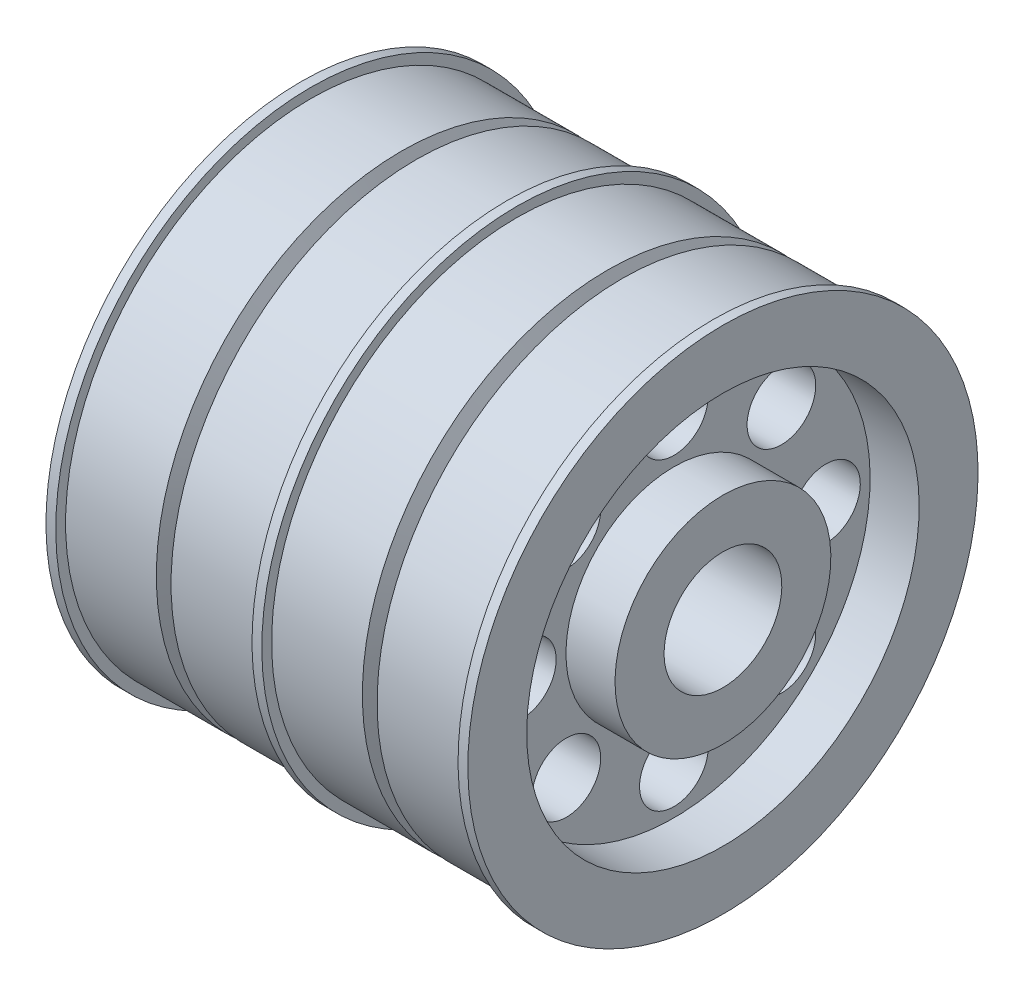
ISO-10303-21;
HEADER;
FILE_DESCRIPTION(('STEP AP214'),'2;1');
FILE_NAME('part.step','',(''),(''),'','','');
FILE_SCHEMA(('AUTOMOTIVE_DESIGN { 1 0 10303 214 1 1 1 1 }'));
ENDSEC;
DATA;
#1=APPLICATION_CONTEXT('core data for automotive mechanical design processes');
#2=APPLICATION_PROTOCOL_DEFINITION('international standard','automotive_design',2000,#1);
#3=PRODUCT_CONTEXT('',#1,'mechanical');
#4=PRODUCT('Part','Part','',(#3));
#5=PRODUCT_RELATED_PRODUCT_CATEGORY('part','',(#4));
#6=PRODUCT_DEFINITION_FORMATION('','',#4);
#7=PRODUCT_DEFINITION_CONTEXT('part definition',#1,'design');
#8=PRODUCT_DEFINITION('design','',#6,#7);
#9=PRODUCT_DEFINITION_SHAPE('','',#8);
#10=(LENGTH_UNIT() NAMED_UNIT(*) SI_UNIT(.MILLI.,.METRE.));
#11=(NAMED_UNIT(*) PLANE_ANGLE_UNIT() SI_UNIT($,.RADIAN.));
#12=(NAMED_UNIT(*) SI_UNIT($,.STERADIAN.) SOLID_ANGLE_UNIT());
#13=UNCERTAINTY_MEASURE_WITH_UNIT(LENGTH_MEASURE(1.E-05),#10,'distance_accuracy_value','');
#14=(GEOMETRIC_REPRESENTATION_CONTEXT(3) GLOBAL_UNCERTAINTY_ASSIGNED_CONTEXT((#13)) GLOBAL_UNIT_ASSIGNED_CONTEXT((#10,
#11,#12)) REPRESENTATION_CONTEXT('',''));
#15=CARTESIAN_POINT('',(0.,0.,0.));
#16=DIRECTION('',(0.,0.,1.));
#17=DIRECTION('',(1.,0.,0.));
#18=AXIS2_PLACEMENT_3D('',#15,#16,#17);
#19=CARTESIAN_POINT('',(64.,-12.,0.));
#20=DIRECTION('',(1.,0.,0.));
#21=DIRECTION('',(0.,1.,0.));
#22=AXIS2_PLACEMENT_3D('',#19,#20,#21);
#23=CONICAL_SURFACE('',#22,47.,1.10714871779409);
#24=CARTESIAN_POINT('',(65.5,-12.,0.));
#25=DIRECTION('',(1.,0.,0.));
#26=DIRECTION('',(0.,1.,0.));
#27=AXIS2_PLACEMENT_3D('',#24,#25,#26);
#28=CIRCLE('',#27,50.);
#29=CARTESIAN_POINT('',(65.5,38.,0.));
#30=VERTEX_POINT('',#29);
#31=EDGE_CURVE('E124',#30,#30,#28,.T.);
#32=ORIENTED_EDGE('',*,*,#31,.F.);
#33=EDGE_LOOP('',(#32));
#34=FACE_BOUND('',#33,.T.);
#35=CARTESIAN_POINT('',(64.,-12.,0.));
#36=DIRECTION('',(1.,0.,0.));
#37=DIRECTION('',(0.,1.,0.));
#38=AXIS2_PLACEMENT_3D('',#35,#36,#37);
#39=CIRCLE('',#38,47.);
#40=CARTESIAN_POINT('',(64.,35.,0.));
#41=VERTEX_POINT('',#40);
#42=EDGE_CURVE('E10',#41,#41,#39,.T.);
#43=ORIENTED_EDGE('',*,*,#42,.T.);
#44=EDGE_LOOP('',(#43));
#45=FACE_BOUND('',#44,.T.);
#46=ADVANCED_FACE('F42',(#34,#45),#23,.T.);
#47=CARTESIAN_POINT('',(62.5,-12.,0.));
#48=DIRECTION('',(-1.,0.,0.));
#49=DIRECTION('',(0.,-1.,0.));
#50=AXIS2_PLACEMENT_3D('',#47,#48,#49);
#51=CONICAL_SURFACE('',#50,50.,1.10714871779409);
#52=ORIENTED_EDGE('',*,*,#42,.F.);
#53=EDGE_LOOP('',(#52));
#54=FACE_BOUND('',#53,.T.);
#55=CARTESIAN_POINT('',(62.5,-12.,0.));
#56=DIRECTION('',(1.,0.,0.));
#57=DIRECTION('',(0.,1.,0.));
#58=AXIS2_PLACEMENT_3D('',#55,#56,#57);
#59=CIRCLE('',#58,50.);
#60=CARTESIAN_POINT('',(62.5,38.,0.));
#61=VERTEX_POINT('',#60);
#62=EDGE_CURVE('E48',#61,#61,#59,.T.);
#63=ORIENTED_EDGE('',*,*,#62,.T.);
#64=EDGE_LOOP('',(#63));
#65=FACE_BOUND('',#64,.T.);
#66=ADVANCED_FACE('F214',(#54,#65),#51,.T.);
#67=CARTESIAN_POINT('',(66.3916208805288,-12.,0.));
#68=DIRECTION('',(1.,0.,0.));
#69=DIRECTION('',(0.,1.,0.));
#70=AXIS2_PLACEMENT_3D('',#67,#68,#69);
#71=CYLINDRICAL_SURFACE('',#70,50.);
#72=ORIENTED_EDGE('',*,*,#62,.F.);
#73=EDGE_LOOP('',(#72));
#74=FACE_BOUND('',#73,.T.);
#75=CARTESIAN_POINT('',(44.,-12.,0.));
#76=DIRECTION('',(1.,0.,0.));
#77=DIRECTION('',(0.,1.,0.));
#78=AXIS2_PLACEMENT_3D('',#75,#76,#77);
#79=CIRCLE('',#78,50.);
#80=CARTESIAN_POINT('',(44.,38.,0.));
#81=VERTEX_POINT('',#80);
#82=EDGE_CURVE('E52',#81,#81,#79,.T.);
#83=ORIENTED_EDGE('',*,*,#82,.T.);
#84=EDGE_LOOP('',(#83));
#85=FACE_BOUND('',#84,.T.);
#86=ADVANCED_FACE('F219',(#74,#85),#71,.T.);
#87=CARTESIAN_POINT('',(44.,-1.52655665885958E-13,0.));
#88=DIRECTION('',(1.,0.,0.));
#89=DIRECTION('',(0.,1.,0.));
#90=AXIS2_PLACEMENT_3D('',#87,#88,#89);
#91=PLANE('',#90);
#92=CARTESIAN_POINT('',(44.,-12.,0.));
#93=DIRECTION('',(1.,0.,0.));
#94=DIRECTION('',(0.,1.,0.));
#95=AXIS2_PLACEMENT_3D('',#92,#93,#94);
#96=CIRCLE('',#95,52.);
#97=CARTESIAN_POINT('',(44.,40.,0.));
#98=VERTEX_POINT('',#97);
#99=EDGE_CURVE('E56',#98,#98,#96,.T.);
#100=ORIENTED_EDGE('',*,*,#99,.T.);
#101=EDGE_LOOP('',(#100));
#102=FACE_BOUND('',#101,.T.);
#103=ORIENTED_EDGE('',*,*,#82,.F.);
#104=EDGE_LOOP('',(#103));
#105=FACE_BOUND('',#104,.T.);
#106=ADVANCED_FACE('F581',(#102,#105),#91,.T.);
#107=CARTESIAN_POINT('',(66.3916208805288,-12.,0.));
#108=DIRECTION('',(1.,0.,0.));
#109=DIRECTION('',(0.,1.,0.));
#110=AXIS2_PLACEMENT_3D('',#107,#108,#109);
#111=CYLINDRICAL_SURFACE('',#110,52.);
#112=CARTESIAN_POINT('',(42.,-12.,0.));
#113=DIRECTION('',(1.,0.,0.));
#114=DIRECTION('',(0.,1.,0.));
#115=AXIS2_PLACEMENT_3D('',#112,#113,#114);
#116=CIRCLE('',#115,52.);
#117=CARTESIAN_POINT('',(42.,40.,0.));
#118=VERTEX_POINT('',#117);
#119=EDGE_CURVE('E61',#118,#118,#116,.T.);
#120=ORIENTED_EDGE('',*,*,#119,.T.);
#121=EDGE_LOOP('',(#120));
#122=FACE_BOUND('',#121,.T.);
#123=ORIENTED_EDGE('',*,*,#99,.F.);
#124=EDGE_LOOP('',(#123));
#125=FACE_BOUND('',#124,.T.);
#126=ADVANCED_FACE('F569',(#122,#125),#111,.T.);
#127=CARTESIAN_POINT('',(42.,0.,0.));
#128=DIRECTION('',(-1.,0.,0.));
#129=DIRECTION('',(0.,-1.,0.));
#130=AXIS2_PLACEMENT_3D('',#127,#128,#129);
#131=PLANE('',#130);
#132=CARTESIAN_POINT('',(42.,-12.,0.));
#133=DIRECTION('',(1.,0.,0.));
#134=DIRECTION('',(0.,1.,0.));
#135=AXIS2_PLACEMENT_3D('',#132,#133,#134);
#136=CIRCLE('',#135,50.);
#137=CARTESIAN_POINT('',(42.,38.,0.));
#138=VERTEX_POINT('',#137);
#139=EDGE_CURVE('E64',#138,#138,#136,.T.);
#140=ORIENTED_EDGE('',*,*,#139,.T.);
#141=EDGE_LOOP('',(#140));
#142=FACE_BOUND('',#141,.T.);
#143=ORIENTED_EDGE('',*,*,#119,.F.);
#144=EDGE_LOOP('',(#143));
#145=FACE_BOUND('',#144,.T.);
#146=ADVANCED_FACE('F557',(#142,#145),#131,.T.);
#147=CARTESIAN_POINT('',(66.3916208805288,-12.,0.));
#148=DIRECTION('',(1.,0.,0.));
#149=DIRECTION('',(0.,1.,0.));
#150=AXIS2_PLACEMENT_3D('',#147,#148,#149);
#151=CYLINDRICAL_SURFACE('',#150,50.);
#152=ORIENTED_EDGE('',*,*,#139,.F.);
#153=EDGE_LOOP('',(#152));
#154=FACE_BOUND('',#153,.T.);
#155=CARTESIAN_POINT('',(23.5,-12.,0.));
#156=DIRECTION('',(1.,0.,0.));
#157=DIRECTION('',(0.,1.,0.));
#158=AXIS2_PLACEMENT_3D('',#155,#156,#157);
#159=CIRCLE('',#158,50.);
#160=CARTESIAN_POINT('',(23.5,38.,0.));
#161=VERTEX_POINT('',#160);
#162=EDGE_CURVE('E67',#161,#161,#159,.T.);
#163=ORIENTED_EDGE('',*,*,#162,.T.);
#164=EDGE_LOOP('',(#163));
#165=FACE_BOUND('',#164,.T.);
#166=ADVANCED_FACE('F545',(#154,#165),#151,.T.);
#167=CARTESIAN_POINT('',(22.,-12.,0.));
#168=DIRECTION('',(1.,0.,0.));
#169=DIRECTION('',(0.,1.,0.));
#170=AXIS2_PLACEMENT_3D('',#167,#168,#169);
#171=CONICAL_SURFACE('',#170,47.,1.10714871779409);
#172=ORIENTED_EDGE('',*,*,#162,.F.);
#173=EDGE_LOOP('',(#172));
#174=FACE_BOUND('',#173,.T.);
#175=CARTESIAN_POINT('',(22.,-12.,0.));
#176=DIRECTION('',(1.,0.,0.));
#177=DIRECTION('',(0.,1.,0.));
#178=AXIS2_PLACEMENT_3D('',#175,#176,#177);
#179=CIRCLE('',#178,47.);
#180=CARTESIAN_POINT('',(22.,35.,0.));
#181=VERTEX_POINT('',#180);
#182=EDGE_CURVE('E70',#181,#181,#179,.T.);
#183=ORIENTED_EDGE('',*,*,#182,.T.);
#184=EDGE_LOOP('',(#183));
#185=FACE_BOUND('',#184,.T.);
#186=ADVANCED_FACE('F533',(#174,#185),#171,.T.);
#187=CARTESIAN_POINT('',(20.5,-12.,0.));
#188=DIRECTION('',(-1.,0.,0.));
#189=DIRECTION('',(0.,-1.,0.));
#190=AXIS2_PLACEMENT_3D('',#187,#188,#189);
#191=CONICAL_SURFACE('',#190,50.,1.10714871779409);
#192=ORIENTED_EDGE('',*,*,#182,.F.);
#193=EDGE_LOOP('',(#192));
#194=FACE_BOUND('',#193,.T.);
#195=CARTESIAN_POINT('',(20.5,-12.,0.));
#196=DIRECTION('',(1.,0.,0.));
#197=DIRECTION('',(0.,1.,0.));
#198=AXIS2_PLACEMENT_3D('',#195,#196,#197);
#199=CIRCLE('',#198,50.);
#200=CARTESIAN_POINT('',(20.5,38.,0.));
#201=VERTEX_POINT('',#200);
#202=EDGE_CURVE('E73',#201,#201,#199,.T.);
#203=ORIENTED_EDGE('',*,*,#202,.T.);
#204=EDGE_LOOP('',(#203));
#205=FACE_BOUND('',#204,.T.);
#206=ADVANCED_FACE('F521',(#194,#205),#191,.T.);
#207=CARTESIAN_POINT('',(66.3916208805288,-12.,0.));
#208=DIRECTION('',(1.,0.,0.));
#209=DIRECTION('',(0.,1.,0.));
#210=AXIS2_PLACEMENT_3D('',#207,#208,#209);
#211=CYLINDRICAL_SURFACE('',#210,50.);
#212=ORIENTED_EDGE('',*,*,#202,.F.);
#213=EDGE_LOOP('',(#212));
#214=FACE_BOUND('',#213,.T.);
#215=CARTESIAN_POINT('',(2.,-12.,0.));
#216=DIRECTION('',(1.,0.,0.));
#217=DIRECTION('',(0.,1.,0.));
#218=AXIS2_PLACEMENT_3D('',#215,#216,#217);
#219=CIRCLE('',#218,50.);
#220=CARTESIAN_POINT('',(2.,38.,0.));
#221=VERTEX_POINT('',#220);
#222=EDGE_CURVE('E76',#221,#221,#219,.T.);
#223=ORIENTED_EDGE('',*,*,#222,.T.);
#224=EDGE_LOOP('',(#223));
#225=FACE_BOUND('',#224,.T.);
#226=ADVANCED_FACE('F509',(#214,#225),#211,.T.);
#227=CARTESIAN_POINT('',(2.00000000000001,0.,0.));
#228=DIRECTION('',(-1.,0.,0.));
#229=DIRECTION('',(0.,-1.,0.));
#230=AXIS2_PLACEMENT_3D('',#227,#228,#229);
#231=PLANE('',#230);
#232=ORIENTED_EDGE('',*,*,#222,.F.);
#233=EDGE_LOOP('',(#232));
#234=FACE_BOUND('',#233,.T.);
#235=CARTESIAN_POINT('',(2.,-12.,0.));
#236=DIRECTION('',(1.,0.,0.));
#237=DIRECTION('',(0.,1.,0.));
#238=AXIS2_PLACEMENT_3D('',#235,#236,#237);
#239=CIRCLE('',#238,52.);
#240=CARTESIAN_POINT('',(1.99999999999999,40.,0.));
#241=VERTEX_POINT('',#240);
#242=EDGE_CURVE('E79',#241,#241,#239,.T.);
#243=ORIENTED_EDGE('',*,*,#242,.T.);
#244=EDGE_LOOP('',(#243));
#245=FACE_BOUND('',#244,.T.);
#246=ADVANCED_FACE('F497',(#234,#245),#231,.F.);
#247=CARTESIAN_POINT('',(66.3916208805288,-12.,0.));
#248=DIRECTION('',(1.,0.,0.));
#249=DIRECTION('',(0.,1.,0.));
#250=AXIS2_PLACEMENT_3D('',#247,#248,#249);
#251=CYLINDRICAL_SURFACE('',#250,52.);
#252=ORIENTED_EDGE('',*,*,#242,.F.);
#253=EDGE_LOOP('',(#252));
#254=FACE_BOUND('',#253,.T.);
#255=CARTESIAN_POINT('',(0.,-12.,0.));
#256=DIRECTION('',(1.,0.,0.));
#257=DIRECTION('',(0.,1.,0.));
#258=AXIS2_PLACEMENT_3D('',#255,#256,#257);
#259=CIRCLE('',#258,52.);
#260=CARTESIAN_POINT('',(0.,40.,0.));
#261=VERTEX_POINT('',#260);
#262=EDGE_CURVE('E82',#261,#261,#259,.T.);
#263=ORIENTED_EDGE('',*,*,#262,.T.);
#264=EDGE_LOOP('',(#263));
#265=FACE_BOUND('',#264,.T.);
#266=ADVANCED_FACE('F485',(#254,#265),#251,.T.);
#267=CARTESIAN_POINT('',(0.,0.,0.));
#268=DIRECTION('',(1.,0.,0.));
#269=DIRECTION('',(0.,1.,0.));
#270=AXIS2_PLACEMENT_3D('',#267,#268,#269);
#271=PLANE('',#270);
#272=ORIENTED_EDGE('',*,*,#262,.F.);
#273=EDGE_LOOP('',(#272));
#274=FACE_BOUND('',#273,.T.);
#275=CARTESIAN_POINT('',(0.,-12.,0.));
#276=DIRECTION('',(1.,0.,0.));
#277=DIRECTION('',(0.,1.,0.));
#278=AXIS2_PLACEMENT_3D('',#275,#276,#277);
#279=CIRCLE('',#278,40.);
#280=CARTESIAN_POINT('',(0.,28.,0.));
#281=VERTEX_POINT('',#280);
#282=EDGE_CURVE('E85',#281,#281,#279,.T.);
#283=ORIENTED_EDGE('',*,*,#282,.T.);
#284=EDGE_LOOP('',(#283));
#285=FACE_BOUND('',#284,.T.);
#286=ADVANCED_FACE('F473',(#274,#285),#271,.F.);
#287=CARTESIAN_POINT('',(66.3916208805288,-12.,0.));
#288=DIRECTION('',(1.,0.,0.));
#289=DIRECTION('',(0.,1.,0.));
#290=AXIS2_PLACEMENT_3D('',#287,#288,#289);
#291=CYLINDRICAL_SURFACE('',#290,40.);
#292=ORIENTED_EDGE('',*,*,#282,.F.);
#293=EDGE_LOOP('',(#292));
#294=FACE_BOUND('',#293,.T.);
#295=CARTESIAN_POINT('',(10.,-12.,0.));
#296=DIRECTION('',(1.,0.,0.));
#297=DIRECTION('',(0.,1.,0.));
#298=AXIS2_PLACEMENT_3D('',#295,#296,#297);
#299=CIRCLE('',#298,40.);
#300=CARTESIAN_POINT('',(10.,28.,0.));
#301=VERTEX_POINT('',#300);
#302=EDGE_CURVE('E88',#301,#301,#299,.T.);
#303=ORIENTED_EDGE('',*,*,#302,.T.);
#304=EDGE_LOOP('',(#303));
#305=FACE_BOUND('',#304,.T.);
#306=ADVANCED_FACE('F467',(#294,#305),#291,.F.);
#307=CARTESIAN_POINT('',(10.,0.,0.));
#308=DIRECTION('',(1.,0.,0.));
#309=DIRECTION('',(0.,1.,0.));
#310=AXIS2_PLACEMENT_3D('',#307,#308,#309);
#311=PLANE('',#310);
#312=CARTESIAN_POINT('',(10.,-11.9999999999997,31.));
#313=DIRECTION('',(1.,0.,0.));
#314=DIRECTION('',(0.,1.,0.));
#315=AXIS2_PLACEMENT_3D('',#312,#313,#314);
#316=CIRCLE('',#315,7.);
#317=CARTESIAN_POINT('',(10.,-4.99999999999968,31.));
#318=VERTEX_POINT('',#317);
#319=EDGE_CURVE('E127',#318,#318,#316,.T.);
#320=ORIENTED_EDGE('',*,*,#319,.T.);
#321=EDGE_LOOP('',(#320));
#322=FACE_BOUND('',#321,.T.);
#323=CARTESIAN_POINT('',(10.,-33.9203102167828,21.9203102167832));
#324=DIRECTION('',(1.,0.,0.));
#325=DIRECTION('',(0.,1.,0.));
#326=AXIS2_PLACEMENT_3D('',#323,#324,#325);
#327=CIRCLE('',#326,7.);
#328=CARTESIAN_POINT('',(10.,-26.9203102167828,21.9203102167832));
#329=VERTEX_POINT('',#328);
#330=EDGE_CURVE('E130',#329,#329,#327,.T.);
#331=ORIENTED_EDGE('',*,*,#330,.T.);
#332=EDGE_LOOP('',(#331));
#333=FACE_BOUND('',#332,.T.);
#334=CARTESIAN_POINT('',(10.,-43.,2.16471843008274E-13));
#335=DIRECTION('',(1.,0.,0.));
#336=DIRECTION('',(0.,1.,0.));
#337=AXIS2_PLACEMENT_3D('',#334,#335,#336);
#338=CIRCLE('',#337,7.);
#339=CARTESIAN_POINT('',(10.,-36.,2.16471843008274E-13));
#340=VERTEX_POINT('',#339);
#341=EDGE_CURVE('E133',#340,#340,#338,.T.);
#342=ORIENTED_EDGE('',*,*,#341,.T.);
#343=EDGE_LOOP('',(#342));
#344=FACE_BOUND('',#343,.T.);
#345=CARTESIAN_POINT('',(10.,-33.9203102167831,-21.9203102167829));
#346=DIRECTION('',(1.,0.,0.));
#347=DIRECTION('',(0.,1.,0.));
#348=AXIS2_PLACEMENT_3D('',#345,#346,#347);
#349=CIRCLE('',#348,7.);
#350=CARTESIAN_POINT('',(10.,-26.9203102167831,-21.9203102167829));
#351=VERTEX_POINT('',#350);
#352=EDGE_CURVE('E136',#351,#351,#349,.T.);
#353=ORIENTED_EDGE('',*,*,#352,.T.);
#354=EDGE_LOOP('',(#353));
#355=FACE_BOUND('',#354,.T.);
#356=CARTESIAN_POINT('',(10.,-12.0000000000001,-31.));
#357=DIRECTION('',(1.,0.,0.));
#358=DIRECTION('',(0.,1.,0.));
#359=AXIS2_PLACEMENT_3D('',#356,#357,#358);
#360=CIRCLE('',#359,7.);
#361=CARTESIAN_POINT('',(10.,-5.00000000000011,-31.));
#362=VERTEX_POINT('',#361);
#363=EDGE_CURVE('E139',#362,#362,#360,.T.);
#364=ORIENTED_EDGE('',*,*,#363,.T.);
#365=EDGE_LOOP('',(#364));
#366=FACE_BOUND('',#365,.T.);
#367=CARTESIAN_POINT('',(10.,9.92031021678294,-21.920310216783));
#368=DIRECTION('',(1.,0.,0.));
#369=DIRECTION('',(0.,1.,0.));
#370=AXIS2_PLACEMENT_3D('',#367,#368,#369);
#371=CIRCLE('',#370,7.);
#372=CARTESIAN_POINT('',(10.,16.9203102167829,-21.920310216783));
#373=VERTEX_POINT('',#372);
#374=EDGE_CURVE('E142',#373,#373,#371,.T.);
#375=ORIENTED_EDGE('',*,*,#374,.T.);
#376=EDGE_LOOP('',(#375));
#377=FACE_BOUND('',#376,.T.);
#378=CARTESIAN_POINT('',(10.,19.,0.));
#379=DIRECTION('',(1.,0.,0.));
#380=DIRECTION('',(0.,1.,0.));
#381=AXIS2_PLACEMENT_3D('',#378,#379,#380);
#382=CIRCLE('',#381,7.);
#383=CARTESIAN_POINT('',(10.,26.,0.));
#384=VERTEX_POINT('',#383);
#385=EDGE_CURVE('E145',#384,#384,#382,.T.);
#386=ORIENTED_EDGE('',*,*,#385,.T.);
#387=EDGE_LOOP('',(#386));
#388=FACE_BOUND('',#387,.T.);
#389=CARTESIAN_POINT('',(10.,9.92031021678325,21.9203102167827));
#390=DIRECTION('',(1.,0.,0.));
#391=DIRECTION('',(0.,1.,0.));
#392=AXIS2_PLACEMENT_3D('',#389,#390,#391);
#393=CIRCLE('',#392,7.);
#394=CARTESIAN_POINT('',(10.,16.9203102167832,21.9203102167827));
#395=VERTEX_POINT('',#394);
#396=EDGE_CURVE('E148',#395,#395,#393,.T.);
#397=ORIENTED_EDGE('',*,*,#396,.T.);
#398=EDGE_LOOP('',(#397));
#399=FACE_BOUND('',#398,.T.);
#400=ORIENTED_EDGE('',*,*,#302,.F.);
#401=EDGE_LOOP('',(#400));
#402=FACE_BOUND('',#401,.T.);
#403=CARTESIAN_POINT('',(10.,-12.,0.));
#404=DIRECTION('',(1.,0.,0.));
#405=DIRECTION('',(0.,1.,0.));
#406=AXIS2_PLACEMENT_3D('',#403,#404,#405);
#407=CIRCLE('',#406,22.);
#408=CARTESIAN_POINT('',(10.,10.,0.));
#409=VERTEX_POINT('',#408);
#410=EDGE_CURVE('E91',#409,#409,#407,.T.);
#411=ORIENTED_EDGE('',*,*,#410,.T.);
#412=EDGE_LOOP('',(#411));
#413=FACE_BOUND('',#412,.T.);
#414=ADVANCED_FACE('F458',(#322,#333,#344,#355,#366,#377,#388,#399,#402,#413),#311,.F.);
#415=CARTESIAN_POINT('',(66.3916208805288,-12.,0.));
#416=DIRECTION('',(1.,0.,0.));
#417=DIRECTION('',(0.,1.,0.));
#418=AXIS2_PLACEMENT_3D('',#415,#416,#417);
#419=CYLINDRICAL_SURFACE('',#418,22.);
#420=ORIENTED_EDGE('',*,*,#410,.F.);
#421=EDGE_LOOP('',(#420));
#422=FACE_BOUND('',#421,.T.);
#423=CARTESIAN_POINT('',(0.,-12.,0.));
#424=DIRECTION('',(1.,0.,0.));
#425=DIRECTION('',(0.,1.,0.));
#426=AXIS2_PLACEMENT_3D('',#423,#424,#425);
#427=CIRCLE('',#426,22.);
#428=CARTESIAN_POINT('',(0.,10.,0.));
#429=VERTEX_POINT('',#428);
#430=EDGE_CURVE('E94',#429,#429,#427,.T.);
#431=ORIENTED_EDGE('',*,*,#430,.T.);
#432=EDGE_LOOP('',(#431));
#433=FACE_BOUND('',#432,.T.);
#434=ADVANCED_FACE('F446',(#422,#433),#419,.T.);
#435=CARTESIAN_POINT('',(0.,0.,0.));
#436=DIRECTION('',(1.,0.,0.));
#437=DIRECTION('',(0.,1.,0.));
#438=AXIS2_PLACEMENT_3D('',#435,#436,#437);
#439=PLANE('',#438);
#440=ORIENTED_EDGE('',*,*,#430,.F.);
#441=EDGE_LOOP('',(#440));
#442=FACE_BOUND('',#441,.T.);
#443=CARTESIAN_POINT('',(0.,-12.,0.));
#444=DIRECTION('',(1.,0.,0.));
#445=DIRECTION('',(0.,1.,0.));
#446=AXIS2_PLACEMENT_3D('',#443,#444,#445);
#447=CIRCLE('',#446,12.);
#448=CARTESIAN_POINT('',(0.,0.,0.));
#449=VERTEX_POINT('',#448);
#450=EDGE_CURVE('E97',#449,#449,#447,.T.);
#451=ORIENTED_EDGE('',*,*,#450,.T.);
#452=EDGE_LOOP('',(#451));
#453=FACE_BOUND('',#452,.T.);
#454=ADVANCED_FACE('F209',(#442,#453),#439,.F.);
#455=CARTESIAN_POINT('',(66.3916208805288,-12.,0.));
#456=DIRECTION('',(1.,0.,0.));
#457=DIRECTION('',(0.,1.,0.));
#458=AXIS2_PLACEMENT_3D('',#455,#456,#457);
#459=CYLINDRICAL_SURFACE('',#458,12.);
#460=ORIENTED_EDGE('',*,*,#450,.F.);
#461=EDGE_LOOP('',(#460));
#462=FACE_BOUND('',#461,.T.);
#463=CARTESIAN_POINT('',(86.,-12.,0.));
#464=DIRECTION('',(1.,0.,0.));
#465=DIRECTION('',(0.,1.,0.));
#466=AXIS2_PLACEMENT_3D('',#463,#464,#465);
#467=CIRCLE('',#466,12.);
#468=CARTESIAN_POINT('',(86.,0.,0.));
#469=VERTEX_POINT('',#468);
#470=EDGE_CURVE('E100',#469,#469,#467,.T.);
#471=ORIENTED_EDGE('',*,*,#470,.T.);
#472=EDGE_LOOP('',(#471));
#473=FACE_BOUND('',#472,.T.);
#474=ADVANCED_FACE('F203',(#462,#473),#459,.F.);
#475=CARTESIAN_POINT('',(86.,0.,0.));
#476=DIRECTION('',(-1.,0.,0.));
#477=DIRECTION('',(0.,-1.,0.));
#478=AXIS2_PLACEMENT_3D('',#475,#476,#477);
#479=PLANE('',#478);
#480=ORIENTED_EDGE('',*,*,#470,.F.);
#481=EDGE_LOOP('',(#480));
#482=FACE_BOUND('',#481,.T.);
#483=CARTESIAN_POINT('',(86.,-12.,0.));
#484=DIRECTION('',(1.,0.,0.));
#485=DIRECTION('',(0.,1.,0.));
#486=AXIS2_PLACEMENT_3D('',#483,#484,#485);
#487=CIRCLE('',#486,22.);
#488=CARTESIAN_POINT('',(86.,10.,0.));
#489=VERTEX_POINT('',#488);
#490=EDGE_CURVE('E103',#489,#489,#487,.T.);
#491=ORIENTED_EDGE('',*,*,#490,.T.);
#492=EDGE_LOOP('',(#491));
#493=FACE_BOUND('',#492,.T.);
#494=ADVANCED_FACE('F198',(#482,#493),#479,.F.);
#495=CARTESIAN_POINT('',(66.3916208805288,-12.,0.));
#496=DIRECTION('',(1.,0.,0.));
#497=DIRECTION('',(0.,1.,0.));
#498=AXIS2_PLACEMENT_3D('',#495,#496,#497);
#499=CYLINDRICAL_SURFACE('',#498,22.);
#500=CARTESIAN_POINT('',(76.,-12.,0.));
#501=DIRECTION('',(1.,0.,0.));
#502=DIRECTION('',(0.,1.,0.));
#503=AXIS2_PLACEMENT_3D('',#500,#501,#502);
#504=CIRCLE('',#503,22.);
#505=CARTESIAN_POINT('',(76.,10.,0.));
#506=VERTEX_POINT('',#505);
#507=EDGE_CURVE('E106',#506,#506,#504,.T.);
#508=ORIENTED_EDGE('',*,*,#507,.T.);
#509=EDGE_LOOP('',(#508));
#510=FACE_BOUND('',#509,.T.);
#511=ORIENTED_EDGE('',*,*,#490,.F.);
#512=EDGE_LOOP('',(#511));
#513=FACE_BOUND('',#512,.T.);
#514=ADVANCED_FACE('F183',(#510,#513),#499,.T.);
#515=CARTESIAN_POINT('',(76.,0.,0.));
#516=DIRECTION('',(1.,0.,0.));
#517=DIRECTION('',(0.,1.,0.));
#518=AXIS2_PLACEMENT_3D('',#515,#516,#517);
#519=PLANE('',#518);
#520=CARTESIAN_POINT('',(76.,-11.9999999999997,31.));
#521=DIRECTION('',(1.,0.,0.));
#522=DIRECTION('',(0.,1.,0.));
#523=AXIS2_PLACEMENT_3D('',#520,#521,#522);
#524=CIRCLE('',#523,7.);
#525=CARTESIAN_POINT('',(76.,-4.99999999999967,31.));
#526=VERTEX_POINT('',#525);
#527=EDGE_CURVE('E154',#526,#526,#524,.T.);
#528=ORIENTED_EDGE('',*,*,#527,.F.);
#529=EDGE_LOOP('',(#528));
#530=FACE_BOUND('',#529,.T.);
#531=CARTESIAN_POINT('',(76.,-33.9203102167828,21.9203102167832));
#532=DIRECTION('',(1.,0.,0.));
#533=DIRECTION('',(0.,1.,0.));
#534=AXIS2_PLACEMENT_3D('',#531,#532,#533);
#535=CIRCLE('',#534,7.);
#536=CARTESIAN_POINT('',(76.,-26.9203102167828,21.9203102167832));
#537=VERTEX_POINT('',#536);
#538=EDGE_CURVE('E162',#537,#537,#535,.T.);
#539=ORIENTED_EDGE('',*,*,#538,.F.);
#540=EDGE_LOOP('',(#539));
#541=FACE_BOUND('',#540,.T.);
#542=CARTESIAN_POINT('',(76.,-43.,2.16471843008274E-13));
#543=DIRECTION('',(1.,0.,0.));
#544=DIRECTION('',(0.,1.,0.));
#545=AXIS2_PLACEMENT_3D('',#542,#543,#544);
#546=CIRCLE('',#545,7.);
#547=CARTESIAN_POINT('',(76.,-36.,2.16471843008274E-13));
#548=VERTEX_POINT('',#547);
#549=EDGE_CURVE('E158',#548,#548,#546,.T.);
#550=ORIENTED_EDGE('',*,*,#549,.F.);
#551=EDGE_LOOP('',(#550));
#552=FACE_BOUND('',#551,.T.);
#553=CARTESIAN_POINT('',(76.,-33.9203102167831,-21.9203102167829));
#554=DIRECTION('',(1.,0.,0.));
#555=DIRECTION('',(0.,1.,0.));
#556=AXIS2_PLACEMENT_3D('',#553,#554,#555);
#557=CIRCLE('',#556,7.);
#558=CARTESIAN_POINT('',(76.,-26.9203102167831,-21.9203102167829));
#559=VERTEX_POINT('',#558);
#560=EDGE_CURVE('E155',#559,#559,#557,.T.);
#561=ORIENTED_EDGE('',*,*,#560,.F.);
#562=EDGE_LOOP('',(#561));
#563=FACE_BOUND('',#562,.T.);
#564=CARTESIAN_POINT('',(76.,-12.0000000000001,-31.));
#565=DIRECTION('',(1.,0.,0.));
#566=DIRECTION('',(0.,1.,0.));
#567=AXIS2_PLACEMENT_3D('',#564,#565,#566);
#568=CIRCLE('',#567,7.);
#569=CARTESIAN_POINT('',(76.,-5.0000000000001,-31.));
#570=VERTEX_POINT('',#569);
#571=EDGE_CURVE('E159',#570,#570,#568,.T.);
#572=ORIENTED_EDGE('',*,*,#571,.F.);
#573=EDGE_LOOP('',(#572));
#574=FACE_BOUND('',#573,.T.);
#575=CARTESIAN_POINT('',(76.,9.92031021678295,-21.920310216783));
#576=DIRECTION('',(1.,0.,0.));
#577=DIRECTION('',(0.,1.,0.));
#578=AXIS2_PLACEMENT_3D('',#575,#576,#577);
#579=CIRCLE('',#578,7.);
#580=CARTESIAN_POINT('',(76.,16.920310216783,-21.920310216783));
#581=VERTEX_POINT('',#580);
#582=EDGE_CURVE('E170',#581,#581,#579,.T.);
#583=ORIENTED_EDGE('',*,*,#582,.F.);
#584=EDGE_LOOP('',(#583));
#585=FACE_BOUND('',#584,.T.);
#586=CARTESIAN_POINT('',(76.,19.,0.));
#587=DIRECTION('',(1.,0.,0.));
#588=DIRECTION('',(0.,1.,0.));
#589=AXIS2_PLACEMENT_3D('',#586,#587,#588);
#590=CIRCLE('',#589,7.);
#591=CARTESIAN_POINT('',(76.,26.,0.));
#592=VERTEX_POINT('',#591);
#593=EDGE_CURVE('E167',#592,#592,#590,.T.);
#594=ORIENTED_EDGE('',*,*,#593,.F.);
#595=EDGE_LOOP('',(#594));
#596=FACE_BOUND('',#595,.T.);
#597=CARTESIAN_POINT('',(76.,9.92031021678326,21.9203102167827));
#598=DIRECTION('',(1.,0.,0.));
#599=DIRECTION('',(0.,1.,0.));
#600=AXIS2_PLACEMENT_3D('',#597,#598,#599);
#601=CIRCLE('',#600,7.);
#602=CARTESIAN_POINT('',(76.,16.9203102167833,21.9203102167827));
#603=VERTEX_POINT('',#602);
#604=EDGE_CURVE('E151',#603,#603,#601,.T.);
#605=ORIENTED_EDGE('',*,*,#604,.F.);
#606=EDGE_LOOP('',(#605));
#607=FACE_BOUND('',#606,.T.);
#608=CARTESIAN_POINT('',(76.,-12.,0.));
#609=DIRECTION('',(1.,0.,0.));
#610=DIRECTION('',(0.,1.,0.));
#611=AXIS2_PLACEMENT_3D('',#608,#609,#610);
#612=CIRCLE('',#611,40.);
#613=CARTESIAN_POINT('',(76.,28.,0.));
#614=VERTEX_POINT('',#613);
#615=EDGE_CURVE('E109',#614,#614,#612,.T.);
#616=ORIENTED_EDGE('',*,*,#615,.T.);
#617=EDGE_LOOP('',(#616));
#618=FACE_BOUND('',#617,.T.);
#619=ORIENTED_EDGE('',*,*,#507,.F.);
#620=EDGE_LOOP('',(#619));
#621=FACE_BOUND('',#620,.T.);
#622=ADVANCED_FACE('F179',(#530,#541,#552,#563,#574,#585,#596,#607,#618,#621),#519,.T.);
#623=CARTESIAN_POINT('',(66.3916208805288,-12.,0.));
#624=DIRECTION('',(1.,0.,0.));
#625=DIRECTION('',(0.,1.,0.));
#626=AXIS2_PLACEMENT_3D('',#623,#624,#625);
#627=CYLINDRICAL_SURFACE('',#626,40.);
#628=CARTESIAN_POINT('',(86.,-12.,0.));
#629=DIRECTION('',(1.,0.,0.));
#630=DIRECTION('',(0.,1.,0.));
#631=AXIS2_PLACEMENT_3D('',#628,#629,#630);
#632=CIRCLE('',#631,40.);
#633=CARTESIAN_POINT('',(86.,28.,0.));
#634=VERTEX_POINT('',#633);
#635=EDGE_CURVE('E112',#634,#634,#632,.T.);
#636=ORIENTED_EDGE('',*,*,#635,.T.);
#637=EDGE_LOOP('',(#636));
#638=FACE_BOUND('',#637,.T.);
#639=ORIENTED_EDGE('',*,*,#615,.F.);
#640=EDGE_LOOP('',(#639));
#641=FACE_BOUND('',#640,.T.);
#642=ADVANCED_FACE('F182',(#638,#641),#627,.F.);
#643=CARTESIAN_POINT('',(86.,0.,0.));
#644=DIRECTION('',(-1.,0.,0.));
#645=DIRECTION('',(0.,-1.,0.));
#646=AXIS2_PLACEMENT_3D('',#643,#644,#645);
#647=PLANE('',#646);
#648=ORIENTED_EDGE('',*,*,#635,.F.);
#649=EDGE_LOOP('',(#648));
#650=FACE_BOUND('',#649,.T.);
#651=CARTESIAN_POINT('',(86.,-12.,0.));
#652=DIRECTION('',(1.,0.,0.));
#653=DIRECTION('',(0.,1.,0.));
#654=AXIS2_PLACEMENT_3D('',#651,#652,#653);
#655=CIRCLE('',#654,52.);
#656=CARTESIAN_POINT('',(86.,40.,0.));
#657=VERTEX_POINT('',#656);
#658=EDGE_CURVE('E115',#657,#657,#655,.T.);
#659=ORIENTED_EDGE('',*,*,#658,.T.);
#660=EDGE_LOOP('',(#659));
#661=FACE_BOUND('',#660,.T.);
#662=ADVANCED_FACE('F244',(#650,#661),#647,.F.);
#663=CARTESIAN_POINT('',(66.3916208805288,-12.,0.));
#664=DIRECTION('',(1.,0.,0.));
#665=DIRECTION('',(0.,1.,0.));
#666=AXIS2_PLACEMENT_3D('',#663,#664,#665);
#667=CYLINDRICAL_SURFACE('',#666,52.);
#668=CARTESIAN_POINT('',(84.,-12.,0.));
#669=DIRECTION('',(1.,0.,0.));
#670=DIRECTION('',(0.,1.,0.));
#671=AXIS2_PLACEMENT_3D('',#668,#669,#670);
#672=CIRCLE('',#671,52.);
#673=CARTESIAN_POINT('',(84.,40.,0.));
#674=VERTEX_POINT('',#673);
#675=EDGE_CURVE('E118',#674,#674,#672,.T.);
#676=ORIENTED_EDGE('',*,*,#675,.T.);
#677=EDGE_LOOP('',(#676));
#678=FACE_BOUND('',#677,.T.);
#679=ORIENTED_EDGE('',*,*,#658,.F.);
#680=EDGE_LOOP('',(#679));
#681=FACE_BOUND('',#680,.T.);
#682=ADVANCED_FACE('F236',(#678,#681),#667,.T.);
#683=CARTESIAN_POINT('',(84.,0.,0.));
#684=DIRECTION('',(-1.,0.,0.));
#685=DIRECTION('',(0.,-1.,0.));
#686=AXIS2_PLACEMENT_3D('',#683,#684,#685);
#687=PLANE('',#686);
#688=CARTESIAN_POINT('',(84.,-12.,0.));
#689=DIRECTION('',(1.,0.,0.));
#690=DIRECTION('',(0.,1.,0.));
#691=AXIS2_PLACEMENT_3D('',#688,#689,#690);
#692=CIRCLE('',#691,50.);
#693=CARTESIAN_POINT('',(84.,38.,0.));
#694=VERTEX_POINT('',#693);
#695=EDGE_CURVE('E121',#694,#694,#692,.T.);
#696=ORIENTED_EDGE('',*,*,#695,.T.);
#697=EDGE_LOOP('',(#696));
#698=FACE_BOUND('',#697,.T.);
#699=ORIENTED_EDGE('',*,*,#675,.F.);
#700=EDGE_LOOP('',(#699));
#701=FACE_BOUND('',#700,.T.);
#702=ADVANCED_FACE('F226',(#698,#701),#687,.T.);
#703=CARTESIAN_POINT('',(66.3916208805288,-12.,0.));
#704=DIRECTION('',(1.,0.,0.));
#705=DIRECTION('',(0.,1.,0.));
#706=AXIS2_PLACEMENT_3D('',#703,#704,#705);
#707=CYLINDRICAL_SURFACE('',#706,50.);
#708=ORIENTED_EDGE('',*,*,#695,.F.);
#709=EDGE_LOOP('',(#708));
#710=FACE_BOUND('',#709,.T.);
#711=ORIENTED_EDGE('',*,*,#31,.T.);
#712=EDGE_LOOP('',(#711));
#713=FACE_BOUND('',#712,.T.);
#714=ADVANCED_FACE('F223',(#710,#713),#707,.T.);
#715=CARTESIAN_POINT('',(0.,9.92031021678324,21.9203102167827));
#716=DIRECTION('',(1.,0.,0.));
#717=DIRECTION('',(0.,1.,0.));
#718=AXIS2_PLACEMENT_3D('',#715,#716,#717);
#719=CYLINDRICAL_SURFACE('',#718,7.);
#720=ORIENTED_EDGE('',*,*,#604,.T.);
#721=EDGE_LOOP('',(#720));
#722=FACE_BOUND('',#721,.T.);
#723=ORIENTED_EDGE('',*,*,#396,.F.);
#724=EDGE_LOOP('',(#723));
#725=FACE_BOUND('',#724,.T.);
#726=ADVANCED_FACE('F225',(#722,#725),#719,.F.);
#727=CARTESIAN_POINT('',(0.,19.,0.));
#728=DIRECTION('',(1.,0.,0.));
#729=DIRECTION('',(0.,1.,0.));
#730=AXIS2_PLACEMENT_3D('',#727,#728,#729);
#731=CYLINDRICAL_SURFACE('',#730,7.);
#732=ORIENTED_EDGE('',*,*,#593,.T.);
#733=EDGE_LOOP('',(#732));
#734=FACE_BOUND('',#733,.T.);
#735=ORIENTED_EDGE('',*,*,#385,.F.);
#736=EDGE_LOOP('',(#735));
#737=FACE_BOUND('',#736,.T.);
#738=ADVANCED_FACE('F233',(#734,#737),#731,.F.);
#739=CARTESIAN_POINT('',(0.,9.92031021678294,-21.920310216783));
#740=DIRECTION('',(1.,0.,0.));
#741=DIRECTION('',(0.,1.,0.));
#742=AXIS2_PLACEMENT_3D('',#739,#740,#741);
#743=CYLINDRICAL_SURFACE('',#742,7.);
#744=ORIENTED_EDGE('',*,*,#582,.T.);
#745=EDGE_LOOP('',(#744));
#746=FACE_BOUND('',#745,.T.);
#747=ORIENTED_EDGE('',*,*,#374,.F.);
#748=EDGE_LOOP('',(#747));
#749=FACE_BOUND('',#748,.T.);
#750=ADVANCED_FACE('F293',(#746,#749),#743,.F.);
#751=CARTESIAN_POINT('',(0.,-12.0000000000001,-31.));
#752=DIRECTION('',(1.,0.,0.));
#753=DIRECTION('',(0.,1.,0.));
#754=AXIS2_PLACEMENT_3D('',#751,#752,#753);
#755=CYLINDRICAL_SURFACE('',#754,7.);
#756=ORIENTED_EDGE('',*,*,#571,.T.);
#757=EDGE_LOOP('',(#756));
#758=FACE_BOUND('',#757,.T.);
#759=ORIENTED_EDGE('',*,*,#363,.F.);
#760=EDGE_LOOP('',(#759));
#761=FACE_BOUND('',#760,.T.);
#762=ADVANCED_FACE('F176',(#758,#761),#755,.F.);
#763=CARTESIAN_POINT('',(0.,-33.9203102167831,-21.9203102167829));
#764=DIRECTION('',(1.,0.,0.));
#765=DIRECTION('',(0.,1.,0.));
#766=AXIS2_PLACEMENT_3D('',#763,#764,#765);
#767=CYLINDRICAL_SURFACE('',#766,7.);
#768=ORIENTED_EDGE('',*,*,#560,.T.);
#769=EDGE_LOOP('',(#768));
#770=FACE_BOUND('',#769,.T.);
#771=ORIENTED_EDGE('',*,*,#352,.F.);
#772=EDGE_LOOP('',(#771));
#773=FACE_BOUND('',#772,.T.);
#774=ADVANCED_FACE('F312',(#770,#773),#767,.F.);
#775=CARTESIAN_POINT('',(0.,-43.,2.16471843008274E-13));
#776=DIRECTION('',(1.,0.,0.));
#777=DIRECTION('',(0.,1.,0.));
#778=AXIS2_PLACEMENT_3D('',#775,#776,#777);
#779=CYLINDRICAL_SURFACE('',#778,7.);
#780=ORIENTED_EDGE('',*,*,#549,.T.);
#781=EDGE_LOOP('',(#780));
#782=FACE_BOUND('',#781,.T.);
#783=ORIENTED_EDGE('',*,*,#341,.F.);
#784=EDGE_LOOP('',(#783));
#785=FACE_BOUND('',#784,.T.);
#786=ADVANCED_FACE('F321',(#782,#785),#779,.F.);
#787=CARTESIAN_POINT('',(0.,-33.9203102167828,21.9203102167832));
#788=DIRECTION('',(1.,0.,0.));
#789=DIRECTION('',(0.,1.,0.));
#790=AXIS2_PLACEMENT_3D('',#787,#788,#789);
#791=CYLINDRICAL_SURFACE('',#790,7.);
#792=ORIENTED_EDGE('',*,*,#538,.T.);
#793=EDGE_LOOP('',(#792));
#794=FACE_BOUND('',#793,.T.);
#795=ORIENTED_EDGE('',*,*,#330,.F.);
#796=EDGE_LOOP('',(#795));
#797=FACE_BOUND('',#796,.T.);
#798=ADVANCED_FACE('F330',(#794,#797),#791,.F.);
#799=CARTESIAN_POINT('',(0.,-11.9999999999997,31.));
#800=DIRECTION('',(1.,0.,0.));
#801=DIRECTION('',(0.,1.,0.));
#802=AXIS2_PLACEMENT_3D('',#799,#800,#801);
#803=CYLINDRICAL_SURFACE('',#802,7.);
#804=ORIENTED_EDGE('',*,*,#527,.T.);
#805=EDGE_LOOP('',(#804));
#806=FACE_BOUND('',#805,.T.);
#807=ORIENTED_EDGE('',*,*,#319,.F.);
#808=EDGE_LOOP('',(#807));
#809=FACE_BOUND('',#808,.T.);
#810=ADVANCED_FACE('F340',(#806,#809),#803,.F.);
#811=CLOSED_SHELL('',(#46,#66,#86,#106,#126,#146,#166,#186,#206,#226,#246,#266,#286,#306,#414,
#434,#454,#474,#494,#514,#622,#642,#662,#682,#702,#714,#726,#738,#750,#762,#774,#786,#798,#810));
#812=MANIFOLD_SOLID_BREP('B2',#811);
#813=ADVANCED_BREP_SHAPE_REPRESENTATION('',(#18,#812),#14);
#814=SHAPE_DEFINITION_REPRESENTATION(#9,#813);
ENDSEC;
END-ISO-10303-21;
